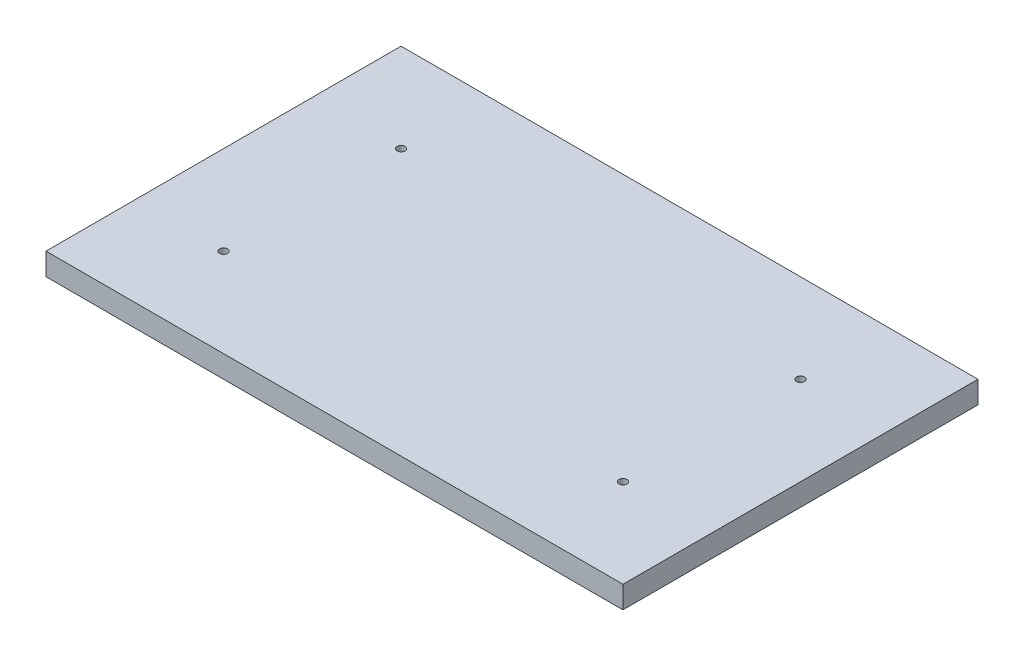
from build123d import *

# Parameters (mm, degrees)
SKETCH1_W                 = 165.1
SKETCH1_H                 = 101.6
EXTRUDE1_DEPTH            = 6.35
F_4_40_TAPPED_HOLE1_D     = 2.2606
F_4_40_TAPPED_HOLE1_DEPTH = 7.62
F_4_40_TAPPED_HOLE1_TIP   = 0.679152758


with BuildPart() as part:
    # Sketch1 → Extrude1 (new body)
    with BuildSketch(Plane(origin=(0, 0, 0), x_dir=(1, 0, 0), z_dir=(0, 1, 0))):
        with Locations((-28.931894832, 4.450853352)):
            Rectangle(SKETCH1_W, SKETCH1_H)
    extrude(amount=EXTRUDE1_DEPTH)

    # 4-40 Tapped Hole1
    with Locations(Plane(origin=(0, 6.35, 0), x_dir=(-1, 0, 0), z_dir=(0, 1, 0))):
        with Locations((86.081894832, 20.949146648), (86.081894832, -29.850853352), (-28.218105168, -29.850853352), (-28.218105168, 20.949146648)):
            Hole(F_4_40_TAPPED_HOLE1_D / 2, depth=F_4_40_TAPPED_HOLE1_DEPTH)
            with Locations((0, 0, -(F_4_40_TAPPED_HOLE1_DEPTH + F_4_40_TAPPED_HOLE1_TIP / 2))):  # 118° drill point
                Cone(0, F_4_40_TAPPED_HOLE1_D / 2, F_4_40_TAPPED_HOLE1_TIP, mode=Mode.SUBTRACT)


solid = part.part
